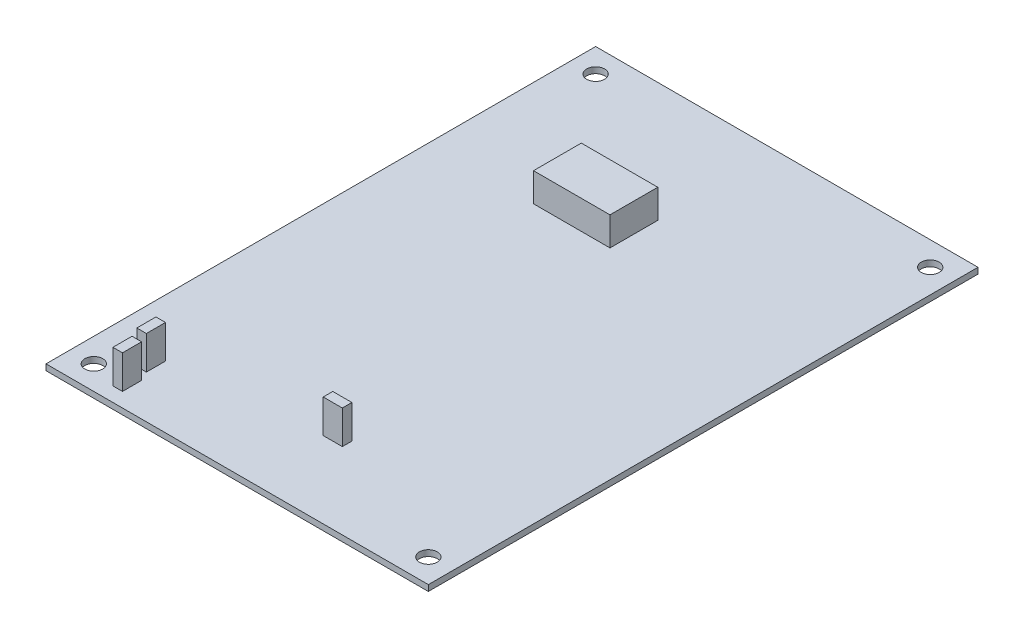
from build123d import *

# Parameters (mm, degrees)
SKETCH1_W           = 101.6
SKETCH1_H           = 146.05
SKETCH1_R           = 2.38125
EXTRUDE1_DEPTH      = 1.5875
SKETCH2_W           = 20.32
SKETCH2_H           = 12.7
BOSS_EXTRUDE1_DEPTH = 7.62
SKETCH3_W           = 5.08
SKETCH3_H           = 2.54
SKETCH3_W_2         = 2.54
SKETCH3_H_2         = 5.08
BOSS_EXTRUDE2_DEPTH = 8.89


with BuildPart() as part:
    # Sketch1 → Extrude1 (new body)
    with BuildSketch(Plane(origin=(0, 0, 0), x_dir=(1, 0, 0), z_dir=(0, 1, 0))):
        Rectangle(SKETCH1_W, SKETCH1_H)
        with Locations(Location((-44.45, 66.675, 0), (0, 0, 270))):
            Circle(SKETCH1_R, mode=Mode.SUBTRACT)
        with Locations(Location((44.45, 66.675, 0), (0, 0, 270))):
            Circle(SKETCH1_R, mode=Mode.SUBTRACT)
        with Locations(Location((44.45, -66.675, 0), (0, 0, 270))):
            Circle(SKETCH1_R, mode=Mode.SUBTRACT)
        with Locations(Location((-44.45, -66.675, 0), (0, 0, 270))):
            Circle(SKETCH1_R, mode=Mode.SUBTRACT)
    extrude(amount=EXTRUDE1_DEPTH)

    # Sketch2 → Boss-Extrude1 (add)
    with BuildSketch(Plane(origin=(0, 1.5875, 0), x_dir=(1, 0, 0), z_dir=(0, 1, 0))):
        with Locations((-12.7, 34.925)):
            Rectangle(SKETCH2_W, SKETCH2_H)
    extrude(amount=BOSS_EXTRUDE1_DEPTH)

    # Sketch3 → Boss-Extrude2 (add)
    with BuildSketch(Plane(origin=(0, 1.5875, 0), x_dir=(1, 0, 0), z_dir=(0, 1, 0))):
        with Locations((5.08, -51.435)):
            Rectangle(SKETCH3_W, SKETCH3_H)
        with Locations((-36.83, -59.055)):
            Rectangle(SKETCH3_W_2, SKETCH3_H_2)
        with Locations((-35.56, -66.675)):
            Rectangle(SKETCH3_W_2, SKETCH3_H_2)
    extrude(amount=BOSS_EXTRUDE2_DEPTH)


solid = part.part
